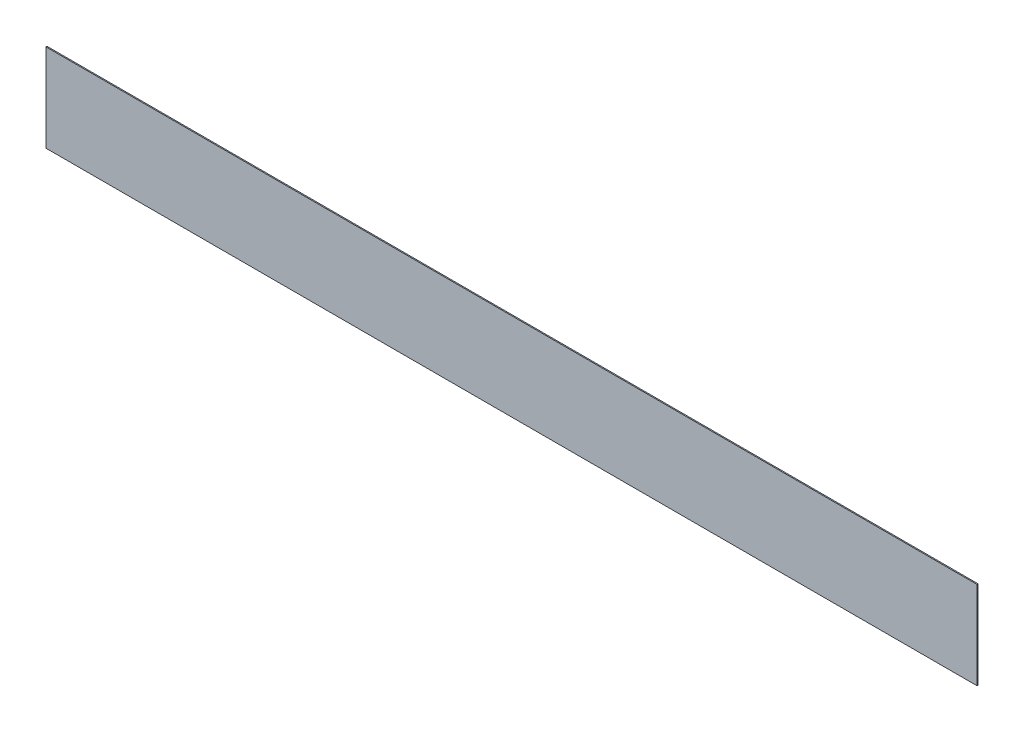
ISO-10303-21;
HEADER;
FILE_DESCRIPTION(('STEP AP214'),'2;1');
FILE_NAME('part.step','',(''),(''),'','','');
FILE_SCHEMA(('AUTOMOTIVE_DESIGN { 1 0 10303 214 1 1 1 1 }'));
ENDSEC;
DATA;
#1=APPLICATION_CONTEXT('core data for automotive mechanical design processes');
#2=APPLICATION_PROTOCOL_DEFINITION('international standard','automotive_design',2000,#1);
#3=PRODUCT_CONTEXT('',#1,'mechanical');
#4=PRODUCT('Part','Part','',(#3));
#5=PRODUCT_RELATED_PRODUCT_CATEGORY('part','',(#4));
#6=PRODUCT_DEFINITION_FORMATION('','',#4);
#7=PRODUCT_DEFINITION_CONTEXT('part definition',#1,'design');
#8=PRODUCT_DEFINITION('design','',#6,#7);
#9=PRODUCT_DEFINITION_SHAPE('','',#8);
#10=(LENGTH_UNIT() NAMED_UNIT(*) SI_UNIT(.MILLI.,.METRE.));
#11=(NAMED_UNIT(*) PLANE_ANGLE_UNIT() SI_UNIT($,.RADIAN.));
#12=(NAMED_UNIT(*) SI_UNIT($,.STERADIAN.) SOLID_ANGLE_UNIT());
#13=UNCERTAINTY_MEASURE_WITH_UNIT(LENGTH_MEASURE(1.E-05),#10,'distance_accuracy_value','');
#14=(GEOMETRIC_REPRESENTATION_CONTEXT(3) GLOBAL_UNCERTAINTY_ASSIGNED_CONTEXT((#13)) GLOBAL_UNIT_ASSIGNED_CONTEXT((#10,
#11,#12)) REPRESENTATION_CONTEXT('',''));
#15=CARTESIAN_POINT('',(0.,0.,0.));
#16=DIRECTION('',(0.,0.,1.));
#17=DIRECTION('',(1.,0.,0.));
#18=AXIS2_PLACEMENT_3D('',#15,#16,#17);
#19=CARTESIAN_POINT('',(-118.131068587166,38.8524363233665,2.));
#20=DIRECTION('',(1.,0.,0.));
#21=DIRECTION('',(0.,1.,0.));
#22=AXIS2_PLACEMENT_3D('',#19,#20,#21);
#23=PLANE('',#22);
#24=DIRECTION('',(0.,-1.,0.));
#25=VECTOR('',#24,1.);
#26=CARTESIAN_POINT('',(-118.131068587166,38.8524363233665,0.));
#27=LINE('',#26,#25);
#28=CARTESIAN_POINT('',(-118.131068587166,38.8524363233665,0.));
#29=VERTEX_POINT('',#28);
#30=CARTESIAN_POINT('',(-118.131068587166,-126.147563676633,0.));
#31=VERTEX_POINT('',#30);
#32=EDGE_CURVE('E95',#29,#31,#27,.T.);
#33=ORIENTED_EDGE('',*,*,#32,.T.);
#34=DIRECTION('',(0.,0.,-1.));
#35=VECTOR('',#34,1.);
#36=CARTESIAN_POINT('',(-118.131068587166,-126.147563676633,2.));
#37=LINE('',#36,#35);
#38=CARTESIAN_POINT('',(-118.131068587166,-126.147563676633,2.));
#39=VERTEX_POINT('',#38);
#40=EDGE_CURVE('E11',#39,#31,#37,.T.);
#41=ORIENTED_EDGE('',*,*,#40,.F.);
#42=DIRECTION('',(0.,-1.,0.));
#43=VECTOR('',#42,1.);
#44=CARTESIAN_POINT('',(-118.131068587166,38.8524363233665,2.));
#45=LINE('',#44,#43);
#46=CARTESIAN_POINT('',(-118.131068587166,38.8524363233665,2.));
#47=VERTEX_POINT('',#46);
#48=EDGE_CURVE('E83',#47,#39,#45,.T.);
#49=ORIENTED_EDGE('',*,*,#48,.F.);
#50=DIRECTION('',(0.,0.,-1.));
#51=VECTOR('',#50,1.);
#52=CARTESIAN_POINT('',(-118.131068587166,38.8524363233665,2.));
#53=LINE('',#52,#51);
#54=EDGE_CURVE('E91',#47,#29,#53,.T.);
#55=ORIENTED_EDGE('',*,*,#54,.T.);
#56=EDGE_LOOP('',(#33,#41,#49,#55));
#57=FACE_BOUND('',#56,.T.);
#58=ADVANCED_FACE('F32',(#57),#23,.F.);
#59=CARTESIAN_POINT('',(-118.131068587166,-126.147563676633,2.));
#60=DIRECTION('',(0.,1.,0.));
#61=DIRECTION('',(0.,0.,1.));
#62=AXIS2_PLACEMENT_3D('',#59,#60,#61);
#63=PLANE('',#62);
#64=DIRECTION('',(1.,0.,0.));
#65=VECTOR('',#64,1.);
#66=CARTESIAN_POINT('',(-118.131068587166,-126.147563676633,0.));
#67=LINE('',#66,#65);
#68=CARTESIAN_POINT('',(1631.86893141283,-126.147563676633,0.));
#69=VERTEX_POINT('',#68);
#70=EDGE_CURVE('E87',#31,#69,#67,.T.);
#71=ORIENTED_EDGE('',*,*,#70,.T.);
#72=DIRECTION('',(0.,0.,-1.));
#73=VECTOR('',#72,1.);
#74=CARTESIAN_POINT('',(1631.86893141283,-126.147563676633,2.));
#75=LINE('',#74,#73);
#76=CARTESIAN_POINT('',(1631.86893141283,-126.147563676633,2.));
#77=VERTEX_POINT('',#76);
#78=EDGE_CURVE('E40',#77,#69,#75,.T.);
#79=ORIENTED_EDGE('',*,*,#78,.F.);
#80=DIRECTION('',(1.,0.,0.));
#81=VECTOR('',#80,1.);
#82=CARTESIAN_POINT('',(-118.131068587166,-126.147563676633,2.));
#83=LINE('',#82,#81);
#84=EDGE_CURVE('E78',#39,#77,#83,.T.);
#85=ORIENTED_EDGE('',*,*,#84,.F.);
#86=ORIENTED_EDGE('',*,*,#40,.T.);
#87=EDGE_LOOP('',(#71,#79,#85,#86));
#88=FACE_BOUND('',#87,.T.);
#89=ADVANCED_FACE('F86',(#88),#63,.F.);
#90=CARTESIAN_POINT('',(1631.86893141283,38.8524363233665,2.));
#91=DIRECTION('',(-1.,0.,0.));
#92=DIRECTION('',(0.,0.,1.));
#93=AXIS2_PLACEMENT_3D('',#90,#91,#92);
#94=PLANE('',#93);
#95=DIRECTION('',(0.,1.,0.));
#96=VECTOR('',#95,1.);
#97=CARTESIAN_POINT('',(1631.86893141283,38.8524363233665,0.));
#98=LINE('',#97,#96);
#99=CARTESIAN_POINT('',(1631.86893141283,38.8524363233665,0.));
#100=VERTEX_POINT('',#99);
#101=EDGE_CURVE('E65',#69,#100,#98,.T.);
#102=ORIENTED_EDGE('',*,*,#101,.T.);
#103=DIRECTION('',(0.,0.,-1.));
#104=VECTOR('',#103,1.);
#105=CARTESIAN_POINT('',(1631.86893141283,38.8524363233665,2.));
#106=LINE('',#105,#104);
#107=CARTESIAN_POINT('',(1631.86893141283,38.8524363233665,2.));
#108=VERTEX_POINT('',#107);
#109=EDGE_CURVE('E88',#108,#100,#106,.T.);
#110=ORIENTED_EDGE('',*,*,#109,.F.);
#111=DIRECTION('',(0.,1.,0.));
#112=VECTOR('',#111,1.);
#113=CARTESIAN_POINT('',(1631.86893141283,38.8524363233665,2.));
#114=LINE('',#113,#112);
#115=EDGE_CURVE('E81',#77,#108,#114,.T.);
#116=ORIENTED_EDGE('',*,*,#115,.F.);
#117=ORIENTED_EDGE('',*,*,#78,.T.);
#118=EDGE_LOOP('',(#102,#110,#116,#117));
#119=FACE_BOUND('',#118,.T.);
#120=ADVANCED_FACE('F89',(#119),#94,.F.);
#121=CARTESIAN_POINT('',(-118.131068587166,38.8524363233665,2.));
#122=DIRECTION('',(0.,-1.,0.));
#123=DIRECTION('',(0.,0.,-1.));
#124=AXIS2_PLACEMENT_3D('',#121,#122,#123);
#125=PLANE('',#124);
#126=DIRECTION('',(-1.,0.,0.));
#127=VECTOR('',#126,1.);
#128=CARTESIAN_POINT('',(-118.131068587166,38.8524363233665,0.));
#129=LINE('',#128,#127);
#130=EDGE_CURVE('E71',#100,#29,#129,.T.);
#131=ORIENTED_EDGE('',*,*,#130,.T.);
#132=ORIENTED_EDGE('',*,*,#54,.F.);
#133=DIRECTION('',(-1.,0.,0.));
#134=VECTOR('',#133,1.);
#135=CARTESIAN_POINT('',(-118.131068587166,38.8524363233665,2.));
#136=LINE('',#135,#134);
#137=EDGE_CURVE('E48',#108,#47,#136,.T.);
#138=ORIENTED_EDGE('',*,*,#137,.F.);
#139=ORIENTED_EDGE('',*,*,#109,.T.);
#140=EDGE_LOOP('',(#131,#132,#138,#139));
#141=FACE_BOUND('',#140,.T.);
#142=ADVANCED_FACE('F102',(#141),#125,.F.);
#143=CARTESIAN_POINT('',(0.,0.,2.));
#144=DIRECTION('',(0.,0.,1.));
#145=DIRECTION('',(1.,0.,0.));
#146=AXIS2_PLACEMENT_3D('',#143,#144,#145);
#147=PLANE('',#146);
#148=ORIENTED_EDGE('',*,*,#48,.T.);
#149=ORIENTED_EDGE('',*,*,#84,.T.);
#150=ORIENTED_EDGE('',*,*,#115,.T.);
#151=ORIENTED_EDGE('',*,*,#137,.T.);
#152=EDGE_LOOP('',(#148,#149,#150,#151));
#153=FACE_BOUND('',#152,.T.);
#154=ADVANCED_FACE('F79',(#153),#147,.T.);
#155=CARTESIAN_POINT('',(0.,0.,0.));
#156=DIRECTION('',(0.,0.,1.));
#157=DIRECTION('',(1.,0.,0.));
#158=AXIS2_PLACEMENT_3D('',#155,#156,#157);
#159=PLANE('',#158);
#160=ORIENTED_EDGE('',*,*,#32,.F.);
#161=ORIENTED_EDGE('',*,*,#130,.F.);
#162=ORIENTED_EDGE('',*,*,#101,.F.);
#163=ORIENTED_EDGE('',*,*,#70,.F.);
#164=EDGE_LOOP('',(#160,#161,#162,#163));
#165=FACE_BOUND('',#164,.T.);
#166=ADVANCED_FACE('F105',(#165),#159,.F.);
#167=CLOSED_SHELL('',(#58,#89,#120,#142,#154,#166));
#168=MANIFOLD_SOLID_BREP('B2',#167);
#169=ADVANCED_BREP_SHAPE_REPRESENTATION('',(#18,#168),#14);
#170=SHAPE_DEFINITION_REPRESENTATION(#9,#169);
ENDSEC;
END-ISO-10303-21;
